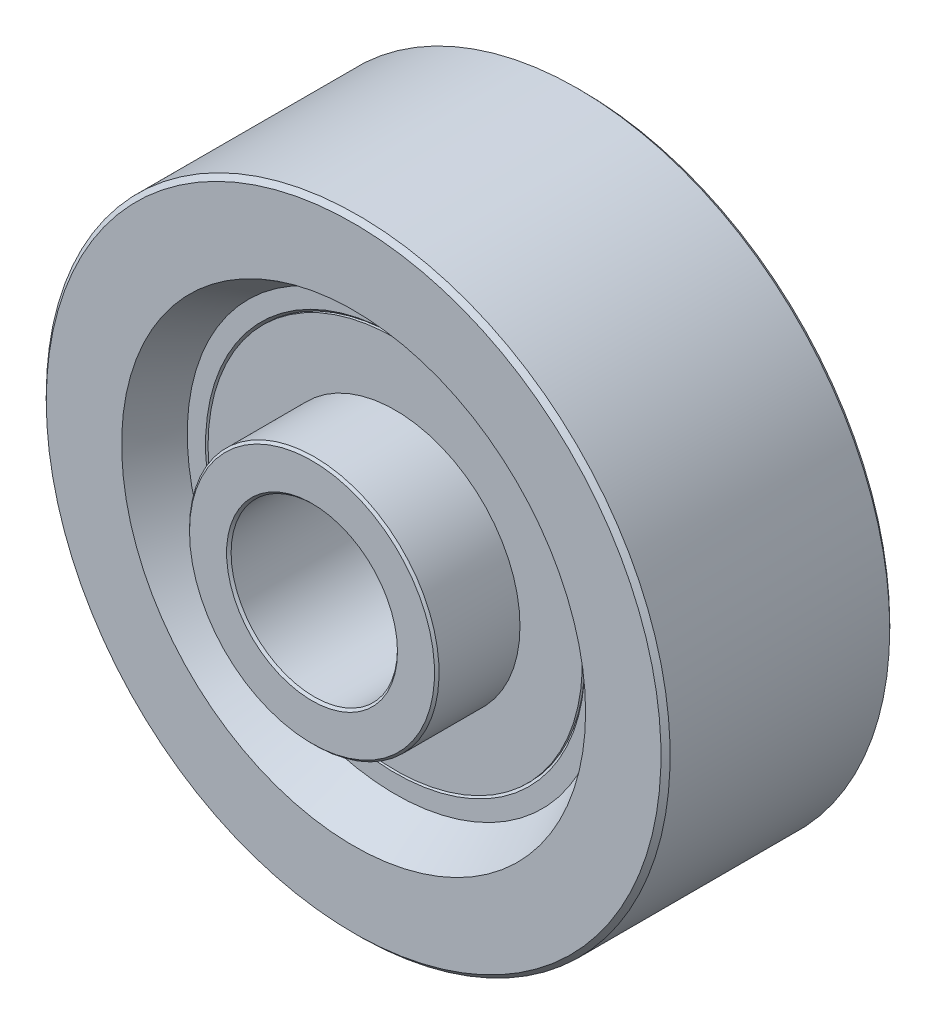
ISO-10303-21;
HEADER;
FILE_DESCRIPTION(('STEP AP214'),'2;1');
FILE_NAME('part.step','',(''),(''),'','','');
FILE_SCHEMA(('AUTOMOTIVE_DESIGN { 1 0 10303 214 1 1 1 1 }'));
ENDSEC;
DATA;
#1=APPLICATION_CONTEXT('core data for automotive mechanical design processes');
#2=APPLICATION_PROTOCOL_DEFINITION('international standard','automotive_design',2000,#1);
#3=PRODUCT_CONTEXT('',#1,'mechanical');
#4=PRODUCT('Part','Part','',(#3));
#5=PRODUCT_RELATED_PRODUCT_CATEGORY('part','',(#4));
#6=PRODUCT_DEFINITION_FORMATION('','',#4);
#7=PRODUCT_DEFINITION_CONTEXT('part definition',#1,'design');
#8=PRODUCT_DEFINITION('design','',#6,#7);
#9=PRODUCT_DEFINITION_SHAPE('','',#8);
#10=(LENGTH_UNIT() NAMED_UNIT(*) SI_UNIT(.MILLI.,.METRE.));
#11=(NAMED_UNIT(*) PLANE_ANGLE_UNIT() SI_UNIT($,.RADIAN.));
#12=(NAMED_UNIT(*) SI_UNIT($,.STERADIAN.) SOLID_ANGLE_UNIT());
#13=UNCERTAINTY_MEASURE_WITH_UNIT(LENGTH_MEASURE(1.E-05),#10,'distance_accuracy_value','');
#14=(GEOMETRIC_REPRESENTATION_CONTEXT(3) GLOBAL_UNCERTAINTY_ASSIGNED_CONTEXT((#13)) GLOBAL_UNIT_ASSIGNED_CONTEXT((#10,
#11,#12)) REPRESENTATION_CONTEXT('',''));
#15=CARTESIAN_POINT('',(0.,0.,0.));
#16=DIRECTION('',(0.,0.,1.));
#17=DIRECTION('',(1.,0.,0.));
#18=AXIS2_PLACEMENT_3D('',#15,#16,#17);
#19=CARTESIAN_POINT('',(0.,0.,11.5586961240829));
#20=DIRECTION('',(0.,0.,-1.));
#21=DIRECTION('',(-1.,0.,0.));
#22=AXIS2_PLACEMENT_3D('',#19,#20,#21);
#23=CYLINDRICAL_SURFACE('',#22,6.);
#24=CARTESIAN_POINT('',(0.,0.,14.8909090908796));
#25=DIRECTION('',(0.,0.,-1.));
#26=DIRECTION('',(0.,1.,0.));
#27=AXIS2_PLACEMENT_3D('',#24,#25,#26);
#28=CIRCLE('',#27,5.99999999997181);
#29=CARTESIAN_POINT('',(0.,5.99999999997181,14.8909090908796));
#30=VERTEX_POINT('',#29);
#31=EDGE_CURVE('E67',#30,#30,#28,.F.);
#32=ORIENTED_EDGE('',*,*,#31,.F.);
#33=EDGE_LOOP('',(#32));
#34=FACE_BOUND('',#33,.T.);
#35=CARTESIAN_POINT('',(0.,0.,11.));
#36=DIRECTION('',(0.,0.,-1.));
#37=DIRECTION('',(-1.,0.,0.));
#38=AXIS2_PLACEMENT_3D('',#35,#36,#37);
#39=CIRCLE('',#38,6.);
#40=CARTESIAN_POINT('',(-6.,0.,11.));
#41=VERTEX_POINT('',#40);
#42=EDGE_CURVE('E25',#41,#41,#39,.T.);
#43=ORIENTED_EDGE('',*,*,#42,.F.);
#44=EDGE_LOOP('',(#43));
#45=FACE_BOUND('',#44,.T.);
#46=ADVANCED_FACE('F12',(#34,#45),#23,.T.);
#47=CARTESIAN_POINT('',(0.,0.,14.8909090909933));
#48=DIRECTION('',(0.,0.,-1.));
#49=DIRECTION('',(-1.,0.,0.));
#50=AXIS2_PLACEMENT_3D('',#47,#48,#49);
#51=CONICAL_SURFACE('',#50,5.99999999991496,0.785398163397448);
#52=CARTESIAN_POINT('',(0.,0.,15.));
#53=DIRECTION('',(0.,0.,-1.));
#54=DIRECTION('',(-1.,0.,0.));
#55=AXIS2_PLACEMENT_3D('',#52,#53,#54);
#56=CIRCLE('',#55,5.89090909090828);
#57=CARTESIAN_POINT('',(-5.89090909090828,0.,15.));
#58=VERTEX_POINT('',#57);
#59=EDGE_CURVE('E66',#58,#58,#56,.F.);
#60=ORIENTED_EDGE('',*,*,#59,.F.);
#61=EDGE_LOOP('',(#60));
#62=FACE_BOUND('',#61,.T.);
#63=ORIENTED_EDGE('',*,*,#31,.T.);
#64=EDGE_LOOP('',(#63));
#65=FACE_BOUND('',#64,.T.);
#66=ADVANCED_FACE('F175',(#62,#65),#51,.T.);
#67=CARTESIAN_POINT('',(0.,5.,15.));
#68=DIRECTION('',(0.,0.,1.));
#69=DIRECTION('',(1.,0.,0.));
#70=AXIS2_PLACEMENT_3D('',#67,#68,#69);
#71=PLANE('',#70);
#72=ORIENTED_EDGE('',*,*,#59,.T.);
#73=EDGE_LOOP('',(#72));
#74=FACE_BOUND('',#73,.T.);
#75=CARTESIAN_POINT('',(0.,0.,15.));
#76=DIRECTION('',(0.,0.,1.));
#77=DIRECTION('',(1.,0.,0.));
#78=AXIS2_PLACEMENT_3D('',#75,#76,#77);
#79=CIRCLE('',#78,4.10909090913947);
#80=CARTESIAN_POINT('',(4.10909090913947,0.,15.));
#81=VERTEX_POINT('',#80);
#82=EDGE_CURVE('E73',#81,#81,#79,.F.);
#83=ORIENTED_EDGE('',*,*,#82,.T.);
#84=EDGE_LOOP('',(#83));
#85=FACE_BOUND('',#84,.T.);
#86=ADVANCED_FACE('F168',(#74,#85),#71,.T.);
#87=CARTESIAN_POINT('',(0.,0.,15.));
#88=DIRECTION('',(0.,0.,1.));
#89=DIRECTION('',(1.,0.,0.));
#90=AXIS2_PLACEMENT_3D('',#87,#88,#89);
#91=CONICAL_SURFACE('',#90,4.10909090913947,0.785398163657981);
#92=CARTESIAN_POINT('',(0.,0.,14.8909090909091));
#93=DIRECTION('',(0.,0.,-1.));
#94=DIRECTION('',(-1.,0.,0.));
#95=AXIS2_PLACEMENT_3D('',#92,#93,#94);
#96=CIRCLE('',#95,4.);
#97=CARTESIAN_POINT('',(-4.,0.,14.8909090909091));
#98=VERTEX_POINT('',#97);
#99=EDGE_CURVE('E56',#98,#98,#96,.T.);
#100=ORIENTED_EDGE('',*,*,#99,.T.);
#101=EDGE_LOOP('',(#100));
#102=FACE_BOUND('',#101,.T.);
#103=ORIENTED_EDGE('',*,*,#82,.F.);
#104=EDGE_LOOP('',(#103));
#105=FACE_BOUND('',#104,.T.);
#106=ADVANCED_FACE('F160',(#102,#105),#91,.F.);
#107=CARTESIAN_POINT('',(0.,0.,7.5));
#108=DIRECTION('',(0.,0.,-1.));
#109=DIRECTION('',(-1.,0.,0.));
#110=AXIS2_PLACEMENT_3D('',#107,#108,#109);
#111=CYLINDRICAL_SURFACE('',#110,4.);
#112=CARTESIAN_POINT('',(0.,0.,0.109090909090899));
#113=DIRECTION('',(0.,0.,-1.));
#114=DIRECTION('',(-1.,0.,0.));
#115=AXIS2_PLACEMENT_3D('',#112,#113,#114);
#116=CIRCLE('',#115,4.);
#117=CARTESIAN_POINT('',(-4.,0.,0.109090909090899));
#118=VERTEX_POINT('',#117);
#119=EDGE_CURVE('E59',#118,#118,#116,.F.);
#120=ORIENTED_EDGE('',*,*,#119,.F.);
#121=EDGE_LOOP('',(#120));
#122=FACE_BOUND('',#121,.T.);
#123=ORIENTED_EDGE('',*,*,#99,.F.);
#124=EDGE_LOOP('',(#123));
#125=FACE_BOUND('',#124,.T.);
#126=ADVANCED_FACE('F156',(#122,#125),#111,.F.);
#127=CARTESIAN_POINT('',(0.,0.,1.36418654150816E-11));
#128=DIRECTION('',(0.,0.,-1.));
#129=DIRECTION('',(-1.,0.,0.));
#130=AXIS2_PLACEMENT_3D('',#127,#128,#129);
#131=CONICAL_SURFACE('',#130,4.10909090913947,0.785398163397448);
#132=CARTESIAN_POINT('',(0.,0.,1.36418654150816E-11));
#133=DIRECTION('',(0.,0.,-1.));
#134=DIRECTION('',(-1.,0.,0.));
#135=AXIS2_PLACEMENT_3D('',#132,#133,#134);
#136=CIRCLE('',#135,4.10909090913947);
#137=CARTESIAN_POINT('',(-4.10909090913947,0.,1.36418654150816E-11));
#138=VERTEX_POINT('',#137);
#139=EDGE_CURVE('E60',#138,#138,#136,.F.);
#140=ORIENTED_EDGE('',*,*,#139,.F.);
#141=EDGE_LOOP('',(#140));
#142=FACE_BOUND('',#141,.T.);
#143=ORIENTED_EDGE('',*,*,#119,.T.);
#144=EDGE_LOOP('',(#143));
#145=FACE_BOUND('',#144,.T.);
#146=ADVANCED_FACE('F159',(#142,#145),#131,.F.);
#147=CARTESIAN_POINT('',(0.,5.,0.));
#148=DIRECTION('',(0.,0.,-1.));
#149=DIRECTION('',(-1.,0.,0.));
#150=AXIS2_PLACEMENT_3D('',#147,#148,#149);
#151=PLANE('',#150);
#152=ORIENTED_EDGE('',*,*,#139,.T.);
#153=EDGE_LOOP('',(#152));
#154=FACE_BOUND('',#153,.T.);
#155=CARTESIAN_POINT('',(0.,0.,1.36418654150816E-11));
#156=DIRECTION('',(0.,0.,1.));
#157=DIRECTION('',(1.,0.,0.));
#158=AXIS2_PLACEMENT_3D('',#155,#156,#157);
#159=CIRCLE('',#158,5.89090909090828);
#160=CARTESIAN_POINT('',(5.89090909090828,0.,1.36418654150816E-11));
#161=VERTEX_POINT('',#160);
#162=EDGE_CURVE('E76',#161,#161,#159,.F.);
#163=ORIENTED_EDGE('',*,*,#162,.T.);
#164=EDGE_LOOP('',(#163));
#165=FACE_BOUND('',#164,.T.);
#166=ADVANCED_FACE('F164',(#154,#165),#151,.T.);
#167=CARTESIAN_POINT('',(0.,0.,0.109090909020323));
#168=DIRECTION('',(0.,0.,1.));
#169=DIRECTION('',(1.,0.,0.));
#170=AXIS2_PLACEMENT_3D('',#167,#168,#169);
#171=CONICAL_SURFACE('',#170,5.99999999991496,0.785398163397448);
#172=CARTESIAN_POINT('',(0.,0.,0.10909090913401));
#173=DIRECTION('',(0.,0.,1.));
#174=DIRECTION('',(0.,1.,0.));
#175=AXIS2_PLACEMENT_3D('',#172,#173,#174);
#176=CIRCLE('',#175,5.99999999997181);
#177=CARTESIAN_POINT('',(0.,5.99999999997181,0.10909090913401));
#178=VERTEX_POINT('',#177);
#179=EDGE_CURVE('E63',#178,#178,#176,.F.);
#180=ORIENTED_EDGE('',*,*,#179,.T.);
#181=EDGE_LOOP('',(#180));
#182=FACE_BOUND('',#181,.T.);
#183=ORIENTED_EDGE('',*,*,#162,.F.);
#184=EDGE_LOOP('',(#183));
#185=FACE_BOUND('',#184,.T.);
#186=ADVANCED_FACE('F96',(#182,#185),#171,.T.);
#187=CARTESIAN_POINT('',(0.,0.,3.4413038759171));
#188=DIRECTION('',(0.,0.,-1.));
#189=DIRECTION('',(-1.,0.,0.));
#190=AXIS2_PLACEMENT_3D('',#187,#188,#189);
#191=CYLINDRICAL_SURFACE('',#190,6.);
#192=CARTESIAN_POINT('',(0.,0.,4.));
#193=DIRECTION('',(0.,0.,-1.));
#194=DIRECTION('',(-1.,0.,0.));
#195=AXIS2_PLACEMENT_3D('',#192,#193,#194);
#196=CIRCLE('',#195,6.);
#197=CARTESIAN_POINT('',(-6.,0.,4.));
#198=VERTEX_POINT('',#197);
#199=EDGE_CURVE('E16',#198,#198,#196,.F.);
#200=ORIENTED_EDGE('',*,*,#199,.F.);
#201=EDGE_LOOP('',(#200));
#202=FACE_BOUND('',#201,.T.);
#203=ORIENTED_EDGE('',*,*,#179,.F.);
#204=EDGE_LOOP('',(#203));
#205=FACE_BOUND('',#204,.T.);
#206=ADVANCED_FACE('F86',(#202,#205),#191,.T.);
#207=CARTESIAN_POINT('',(0.,7.5,4.));
#208=DIRECTION('',(0.,0.,-1.));
#209=DIRECTION('',(-1.,0.,0.));
#210=AXIS2_PLACEMENT_3D('',#207,#208,#209);
#211=PLANE('',#210);
#212=ORIENTED_EDGE('',*,*,#199,.T.);
#213=EDGE_LOOP('',(#212));
#214=FACE_BOUND('',#213,.T.);
#215=CARTESIAN_POINT('',(0.,0.,4.));
#216=DIRECTION('',(0.,0.,-1.));
#217=DIRECTION('',(-1.,0.,0.));
#218=AXIS2_PLACEMENT_3D('',#215,#216,#217);
#219=CIRCLE('',#218,9.);
#220=CARTESIAN_POINT('',(-9.,0.,4.));
#221=VERTEX_POINT('',#220);
#222=EDGE_CURVE('E70',#221,#221,#219,.F.);
#223=ORIENTED_EDGE('',*,*,#222,.F.);
#224=EDGE_LOOP('',(#223));
#225=FACE_BOUND('',#224,.T.);
#226=ADVANCED_FACE('F14',(#214,#225),#211,.T.);
#227=CARTESIAN_POINT('',(0.,0.,4.4375));
#228=DIRECTION('',(0.,0.,-1.));
#229=DIRECTION('',(-1.,0.,0.));
#230=AXIS2_PLACEMENT_3D('',#227,#228,#229);
#231=CYLINDRICAL_SURFACE('',#230,9.);
#232=CARTESIAN_POINT('',(0.,0.,4.12));
#233=DIRECTION('',(0.,0.,-1.));
#234=DIRECTION('',(0.,1.,0.));
#235=AXIS2_PLACEMENT_3D('',#232,#233,#234);
#236=CIRCLE('',#235,9.);
#237=CARTESIAN_POINT('',(0.,9.,4.12));
#238=VERTEX_POINT('',#237);
#239=EDGE_CURVE('E29',#238,#238,#236,.T.);
#240=ORIENTED_EDGE('',*,*,#239,.T.);
#241=EDGE_LOOP('',(#240));
#242=FACE_BOUND('',#241,.T.);
#243=ORIENTED_EDGE('',*,*,#222,.T.);
#244=EDGE_LOOP('',(#243));
#245=FACE_BOUND('',#244,.T.);
#246=ADVANCED_FACE('F83',(#242,#245),#231,.T.);
#247=CARTESIAN_POINT('',(0.,0.,11.));
#248=DIRECTION('',(0.,0.,1.));
#249=DIRECTION('',(1.,0.,0.));
#250=AXIS2_PLACEMENT_3D('',#247,#248,#249);
#251=CONICAL_SURFACE('',#250,9.12,0.785398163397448);
#252=CARTESIAN_POINT('',(0.,0.,10.88));
#253=DIRECTION('',(0.,0.,1.));
#254=DIRECTION('',(0.,1.,0.));
#255=AXIS2_PLACEMENT_3D('',#252,#253,#254);
#256=CIRCLE('',#255,9.);
#257=CARTESIAN_POINT('',(0.,9.,10.88));
#258=VERTEX_POINT('',#257);
#259=EDGE_CURVE('E8',#258,#258,#256,.T.);
#260=ORIENTED_EDGE('',*,*,#259,.F.);
#261=EDGE_LOOP('',(#260));
#262=FACE_BOUND('',#261,.T.);
#263=CARTESIAN_POINT('',(0.,0.,11.));
#264=DIRECTION('',(0.,0.,1.));
#265=DIRECTION('',(1.,0.,0.));
#266=AXIS2_PLACEMENT_3D('',#263,#264,#265);
#267=CIRCLE('',#266,9.12);
#268=CARTESIAN_POINT('',(9.12,0.,11.));
#269=VERTEX_POINT('',#268);
#270=EDGE_CURVE('E53',#269,#269,#267,.F.);
#271=ORIENTED_EDGE('',*,*,#270,.F.);
#272=EDGE_LOOP('',(#271));
#273=FACE_BOUND('',#272,.T.);
#274=ADVANCED_FACE('F94',(#262,#273),#251,.F.);
#275=CARTESIAN_POINT('',(0.,9.56,11.));
#276=DIRECTION('',(0.,0.,1.));
#277=DIRECTION('',(1.,0.,0.));
#278=AXIS2_PLACEMENT_3D('',#275,#276,#277);
#279=PLANE('',#278);
#280=CARTESIAN_POINT('',(0.,0.,11.));
#281=DIRECTION('',(0.,0.,1.));
#282=DIRECTION('',(1.,0.,0.));
#283=AXIS2_PLACEMENT_3D('',#280,#281,#282);
#284=CIRCLE('',#283,10.);
#285=CARTESIAN_POINT('',(10.,0.,11.));
#286=VERTEX_POINT('',#285);
#287=EDGE_CURVE('E47',#286,#286,#284,.T.);
#288=ORIENTED_EDGE('',*,*,#287,.T.);
#289=EDGE_LOOP('',(#288));
#290=FACE_BOUND('',#289,.T.);
#291=ORIENTED_EDGE('',*,*,#270,.T.);
#292=EDGE_LOOP('',(#291));
#293=FACE_BOUND('',#292,.T.);
#294=ADVANCED_FACE('F142',(#290,#293),#279,.T.);
#295=CARTESIAN_POINT('',(0.,0.,13.));
#296=DIRECTION('',(0.,0.,1.));
#297=DIRECTION('',(1.,0.,0.));
#298=AXIS2_PLACEMENT_3D('',#295,#296,#297);
#299=CONICAL_SURFACE('',#298,11.1547005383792,0.523598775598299);
#300=ORIENTED_EDGE('',*,*,#287,.F.);
#301=EDGE_LOOP('',(#300));
#302=FACE_BOUND('',#301,.T.);
#303=CARTESIAN_POINT('',(0.,0.,13.));
#304=DIRECTION('',(0.,0.,1.));
#305=DIRECTION('',(1.,0.,0.));
#306=AXIS2_PLACEMENT_3D('',#303,#304,#305);
#307=CIRCLE('',#306,11.1547005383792);
#308=CARTESIAN_POINT('',(11.1547005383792,0.,13.));
#309=VERTEX_POINT('',#308);
#310=EDGE_CURVE('E41',#309,#309,#307,.F.);
#311=ORIENTED_EDGE('',*,*,#310,.F.);
#312=EDGE_LOOP('',(#311));
#313=FACE_BOUND('',#312,.T.);
#314=ADVANCED_FACE('F134',(#302,#313),#299,.F.);
#315=CARTESIAN_POINT('',(0.,12.9670561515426,13.));
#316=DIRECTION('',(0.,0.,1.));
#317=DIRECTION('',(1.,0.,0.));
#318=AXIS2_PLACEMENT_3D('',#315,#316,#317);
#319=PLANE('',#318);
#320=CARTESIAN_POINT('',(0.,0.,13.));
#321=DIRECTION('',(0.,0.,-1.));
#322=DIRECTION('',(-1.,0.,0.));
#323=AXIS2_PLACEMENT_3D('',#320,#321,#322);
#324=CIRCLE('',#323,14.7794117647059);
#325=CARTESIAN_POINT('',(-14.7794117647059,0.,13.));
#326=VERTEX_POINT('',#325);
#327=EDGE_CURVE('E35',#326,#326,#324,.T.);
#328=ORIENTED_EDGE('',*,*,#327,.F.);
#329=EDGE_LOOP('',(#328));
#330=FACE_BOUND('',#329,.T.);
#331=ORIENTED_EDGE('',*,*,#310,.T.);
#332=EDGE_LOOP('',(#331));
#333=FACE_BOUND('',#332,.T.);
#334=ADVANCED_FACE('F126',(#330,#333),#319,.T.);
#335=CARTESIAN_POINT('',(0.,0.,12.7794117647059));
#336=DIRECTION('',(0.,0.,-1.));
#337=DIRECTION('',(-1.,0.,0.));
#338=AXIS2_PLACEMENT_3D('',#335,#336,#337);
#339=CONICAL_SURFACE('',#338,15.,0.785398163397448);
#340=ORIENTED_EDGE('',*,*,#327,.T.);
#341=EDGE_LOOP('',(#340));
#342=FACE_BOUND('',#341,.T.);
#343=CARTESIAN_POINT('',(0.,0.,12.7794117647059));
#344=DIRECTION('',(0.,0.,-1.));
#345=DIRECTION('',(-1.,0.,0.));
#346=AXIS2_PLACEMENT_3D('',#343,#344,#345);
#347=CIRCLE('',#346,15.);
#348=CARTESIAN_POINT('',(-15.,0.,12.7794117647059));
#349=VERTEX_POINT('',#348);
#350=EDGE_CURVE('E34',#349,#349,#347,.T.);
#351=ORIENTED_EDGE('',*,*,#350,.F.);
#352=EDGE_LOOP('',(#351));
#353=FACE_BOUND('',#352,.T.);
#354=ADVANCED_FACE('F118',(#342,#353),#339,.T.);
#355=CARTESIAN_POINT('',(0.,0.,7.5));
#356=DIRECTION('',(0.,0.,-1.));
#357=DIRECTION('',(-1.,0.,0.));
#358=AXIS2_PLACEMENT_3D('',#355,#356,#357);
#359=CYLINDRICAL_SURFACE('',#358,15.);
#360=ORIENTED_EDGE('',*,*,#350,.T.);
#361=EDGE_LOOP('',(#360));
#362=FACE_BOUND('',#361,.T.);
#363=CARTESIAN_POINT('',(0.,0.,2.2205882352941));
#364=DIRECTION('',(0.,0.,-1.));
#365=DIRECTION('',(-1.,0.,0.));
#366=AXIS2_PLACEMENT_3D('',#363,#364,#365);
#367=CIRCLE('',#366,15.);
#368=CARTESIAN_POINT('',(-15.,0.,2.2205882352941));
#369=VERTEX_POINT('',#368);
#370=EDGE_CURVE('E193',#369,#369,#367,.F.);
#371=ORIENTED_EDGE('',*,*,#370,.T.);
#372=EDGE_LOOP('',(#371));
#373=FACE_BOUND('',#372,.T.);
#374=ADVANCED_FACE('F114',(#362,#373),#359,.T.);
#375=CARTESIAN_POINT('',(0.,0.,2.22058823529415));
#376=DIRECTION('',(0.,0.,1.));
#377=DIRECTION('',(1.,0.,0.));
#378=AXIS2_PLACEMENT_3D('',#375,#376,#377);
#379=CONICAL_SURFACE('',#378,15.,0.785398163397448);
#380=CARTESIAN_POINT('',(0.,0.,2.00000000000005));
#381=DIRECTION('',(0.,0.,1.));
#382=DIRECTION('',(1.,0.,0.));
#383=AXIS2_PLACEMENT_3D('',#380,#381,#382);
#384=CIRCLE('',#383,14.7794117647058);
#385=CARTESIAN_POINT('',(14.7794117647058,0.,2.00000000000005));
#386=VERTEX_POINT('',#385);
#387=EDGE_CURVE('E31',#386,#386,#384,.T.);
#388=ORIENTED_EDGE('',*,*,#387,.T.);
#389=EDGE_LOOP('',(#388));
#390=FACE_BOUND('',#389,.T.);
#391=ORIENTED_EDGE('',*,*,#370,.F.);
#392=EDGE_LOOP('',(#391));
#393=FACE_BOUND('',#392,.T.);
#394=ADVANCED_FACE('F117',(#390,#393),#379,.T.);
#395=CARTESIAN_POINT('',(0.,12.9670561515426,2.));
#396=DIRECTION('',(0.,0.,-1.));
#397=DIRECTION('',(-1.,0.,0.));
#398=AXIS2_PLACEMENT_3D('',#395,#396,#397);
#399=PLANE('',#398);
#400=CARTESIAN_POINT('',(0.,0.,1.99999999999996));
#401=DIRECTION('',(0.,0.,-1.));
#402=DIRECTION('',(-1.,0.,0.));
#403=AXIS2_PLACEMENT_3D('',#400,#401,#402);
#404=CIRCLE('',#403,11.1547005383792);
#405=CARTESIAN_POINT('',(-11.1547005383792,0.,1.99999999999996));
#406=VERTEX_POINT('',#405);
#407=EDGE_CURVE('E38',#406,#406,#404,.F.);
#408=ORIENTED_EDGE('',*,*,#407,.T.);
#409=EDGE_LOOP('',(#408));
#410=FACE_BOUND('',#409,.T.);
#411=ORIENTED_EDGE('',*,*,#387,.F.);
#412=EDGE_LOOP('',(#411));
#413=FACE_BOUND('',#412,.T.);
#414=ADVANCED_FACE('F122',(#410,#413),#399,.T.);
#415=CARTESIAN_POINT('',(0.,0.,1.99999999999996));
#416=DIRECTION('',(0.,0.,-1.));
#417=DIRECTION('',(-1.,0.,0.));
#418=AXIS2_PLACEMENT_3D('',#415,#416,#417);
#419=CONICAL_SURFACE('',#418,11.1547005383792,0.523598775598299);
#420=ORIENTED_EDGE('',*,*,#407,.F.);
#421=EDGE_LOOP('',(#420));
#422=FACE_BOUND('',#421,.T.);
#423=CARTESIAN_POINT('',(0.,0.,4.));
#424=DIRECTION('',(0.,0.,-1.));
#425=DIRECTION('',(-1.,0.,0.));
#426=AXIS2_PLACEMENT_3D('',#423,#424,#425);
#427=CIRCLE('',#426,10.);
#428=CARTESIAN_POINT('',(-10.,0.,4.));
#429=VERTEX_POINT('',#428);
#430=EDGE_CURVE('E44',#429,#429,#427,.T.);
#431=ORIENTED_EDGE('',*,*,#430,.F.);
#432=EDGE_LOOP('',(#431));
#433=FACE_BOUND('',#432,.T.);
#434=ADVANCED_FACE('F130',(#422,#433),#419,.F.);
#435=CARTESIAN_POINT('',(0.,9.56,4.));
#436=DIRECTION('',(0.,0.,-1.));
#437=DIRECTION('',(-1.,0.,0.));
#438=AXIS2_PLACEMENT_3D('',#435,#436,#437);
#439=PLANE('',#438);
#440=CARTESIAN_POINT('',(0.,0.,4.));
#441=DIRECTION('',(0.,0.,-1.));
#442=DIRECTION('',(-1.,0.,0.));
#443=AXIS2_PLACEMENT_3D('',#440,#441,#442);
#444=CIRCLE('',#443,9.12);
#445=CARTESIAN_POINT('',(-9.12,0.,4.));
#446=VERTEX_POINT('',#445);
#447=EDGE_CURVE('E50',#446,#446,#444,.F.);
#448=ORIENTED_EDGE('',*,*,#447,.T.);
#449=EDGE_LOOP('',(#448));
#450=FACE_BOUND('',#449,.T.);
#451=ORIENTED_EDGE('',*,*,#430,.T.);
#452=EDGE_LOOP('',(#451));
#453=FACE_BOUND('',#452,.T.);
#454=ADVANCED_FACE('F138',(#450,#453),#439,.T.);
#455=CARTESIAN_POINT('',(0.,0.,4.));
#456=DIRECTION('',(0.,0.,-1.));
#457=DIRECTION('',(-1.,0.,0.));
#458=AXIS2_PLACEMENT_3D('',#455,#456,#457);
#459=CONICAL_SURFACE('',#458,9.12,0.785398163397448);
#460=ORIENTED_EDGE('',*,*,#447,.F.);
#461=EDGE_LOOP('',(#460));
#462=FACE_BOUND('',#461,.T.);
#463=ORIENTED_EDGE('',*,*,#239,.F.);
#464=EDGE_LOOP('',(#463));
#465=FACE_BOUND('',#464,.T.);
#466=ADVANCED_FACE('F109',(#462,#465),#459,.F.);
#467=CARTESIAN_POINT('',(0.,7.5,11.));
#468=DIRECTION('',(0.,0.,1.));
#469=DIRECTION('',(1.,0.,0.));
#470=AXIS2_PLACEMENT_3D('',#467,#468,#469);
#471=PLANE('',#470);
#472=CARTESIAN_POINT('',(0.,0.,11.));
#473=DIRECTION('',(0.,0.,-1.));
#474=DIRECTION('',(-1.,0.,0.));
#475=AXIS2_PLACEMENT_3D('',#472,#473,#474);
#476=CIRCLE('',#475,9.);
#477=CARTESIAN_POINT('',(-9.,0.,11.));
#478=VERTEX_POINT('',#477);
#479=EDGE_CURVE('E20',#478,#478,#476,.F.);
#480=ORIENTED_EDGE('',*,*,#479,.T.);
#481=EDGE_LOOP('',(#480));
#482=FACE_BOUND('',#481,.T.);
#483=ORIENTED_EDGE('',*,*,#42,.T.);
#484=EDGE_LOOP('',(#483));
#485=FACE_BOUND('',#484,.T.);
#486=ADVANCED_FACE('F102',(#482,#485),#471,.T.);
#487=CARTESIAN_POINT('',(0.,0.,10.5625));
#488=DIRECTION('',(0.,0.,-1.));
#489=DIRECTION('',(-1.,0.,0.));
#490=AXIS2_PLACEMENT_3D('',#487,#488,#489);
#491=CYLINDRICAL_SURFACE('',#490,9.);
#492=ORIENTED_EDGE('',*,*,#479,.F.);
#493=EDGE_LOOP('',(#492));
#494=FACE_BOUND('',#493,.T.);
#495=ORIENTED_EDGE('',*,*,#259,.T.);
#496=EDGE_LOOP('',(#495));
#497=FACE_BOUND('',#496,.T.);
#498=ADVANCED_FACE('F100',(#494,#497),#491,.T.);
#499=CLOSED_SHELL('',(#46,#66,#86,#106,#126,#146,#166,#186,#206,#226,#246,#274,#294,#314,#334,
#354,#374,#394,#414,#434,#454,#466,#486,#498));
#500=MANIFOLD_SOLID_BREP('B1',#499);
#501=ADVANCED_BREP_SHAPE_REPRESENTATION('',(#18,#500),#14);
#502=SHAPE_DEFINITION_REPRESENTATION(#9,#501);
ENDSEC;
END-ISO-10303-21;
